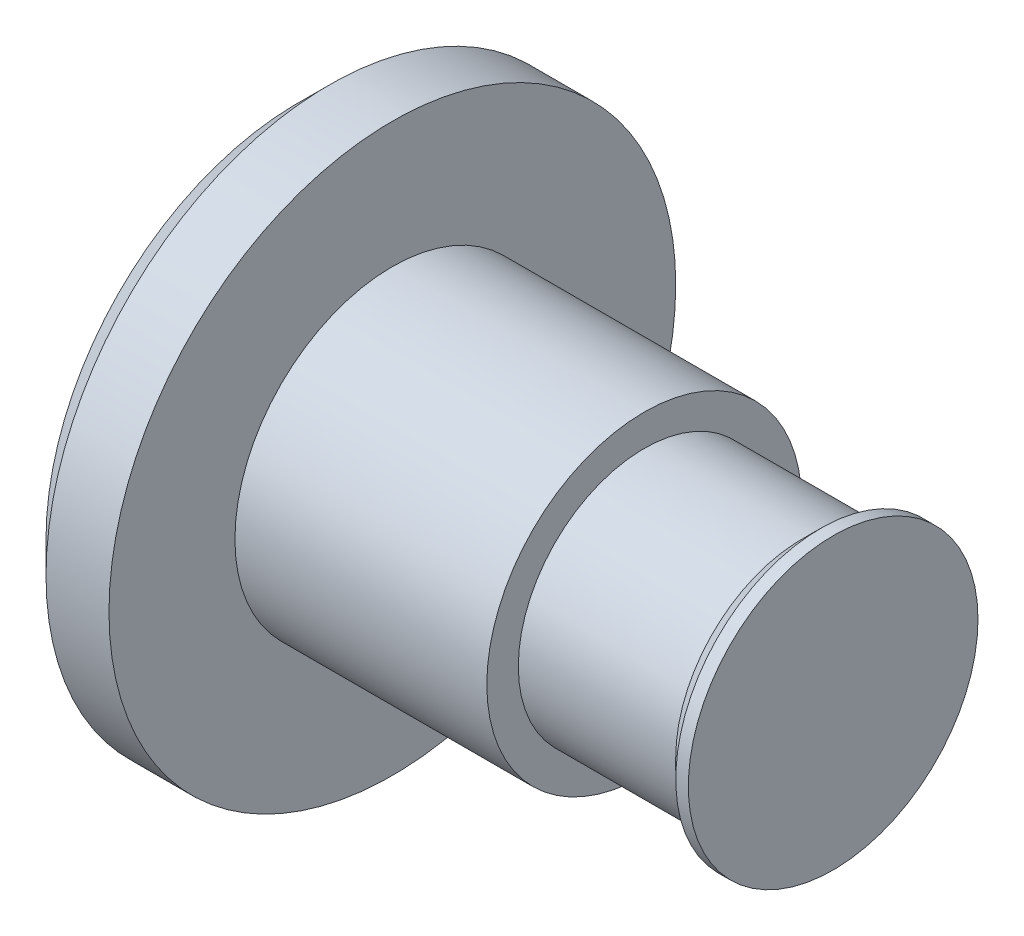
ISO-10303-21;
HEADER;
FILE_DESCRIPTION(('STEP AP214'),'2;1');
FILE_NAME('part.step','',(''),(''),'','','');
FILE_SCHEMA(('AUTOMOTIVE_DESIGN { 1 0 10303 214 1 1 1 1 }'));
ENDSEC;
DATA;
#1=APPLICATION_CONTEXT('core data for automotive mechanical design processes');
#2=APPLICATION_PROTOCOL_DEFINITION('international standard','automotive_design',2000,#1);
#3=PRODUCT_CONTEXT('',#1,'mechanical');
#4=PRODUCT('Part','Part','',(#3));
#5=PRODUCT_RELATED_PRODUCT_CATEGORY('part','',(#4));
#6=PRODUCT_DEFINITION_FORMATION('','',#4);
#7=PRODUCT_DEFINITION_CONTEXT('part definition',#1,'design');
#8=PRODUCT_DEFINITION('design','',#6,#7);
#9=PRODUCT_DEFINITION_SHAPE('','',#8);
#10=(LENGTH_UNIT() NAMED_UNIT(*) SI_UNIT(.MILLI.,.METRE.));
#11=(NAMED_UNIT(*) PLANE_ANGLE_UNIT() SI_UNIT($,.RADIAN.));
#12=(NAMED_UNIT(*) SI_UNIT($,.STERADIAN.) SOLID_ANGLE_UNIT());
#13=UNCERTAINTY_MEASURE_WITH_UNIT(LENGTH_MEASURE(1.E-05),#10,'distance_accuracy_value','');
#14=(GEOMETRIC_REPRESENTATION_CONTEXT(3) GLOBAL_UNCERTAINTY_ASSIGNED_CONTEXT((#13)) GLOBAL_UNIT_ASSIGNED_CONTEXT((#10,
#11,#12)) REPRESENTATION_CONTEXT('',''));
#15=CARTESIAN_POINT('',(0.,0.,0.));
#16=DIRECTION('',(0.,0.,1.));
#17=DIRECTION('',(1.,0.,0.));
#18=AXIS2_PLACEMENT_3D('',#15,#16,#17);
#19=CARTESIAN_POINT('',(8.,0.,0.));
#20=DIRECTION('',(1.,0.,0.));
#21=DIRECTION('',(0.,0.,-1.));
#22=AXIS2_PLACEMENT_3D('',#19,#20,#21);
#23=CONICAL_SURFACE('',#22,2.,0.785398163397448);
#24=CARTESIAN_POINT('',(8.,0.,0.));
#25=DIRECTION('',(-1.,0.,0.));
#26=DIRECTION('',(0.,0.,1.));
#27=AXIS2_PLACEMENT_3D('',#24,#25,#26);
#28=CIRCLE('',#27,2.);
#29=CARTESIAN_POINT('',(8.,0.,2.));
#30=VERTEX_POINT('',#29);
#31=EDGE_CURVE('E60',#30,#30,#28,.T.);
#32=ORIENTED_EDGE('',*,*,#31,.F.);
#33=EDGE_LOOP('',(#32));
#34=FACE_BOUND('',#33,.T.);
#35=CARTESIAN_POINT('',(8.3,0.,0.));
#36=DIRECTION('',(1.,0.,0.));
#37=DIRECTION('',(0.,0.,-1.));
#38=AXIS2_PLACEMENT_3D('',#35,#36,#37);
#39=CIRCLE('',#38,2.3);
#40=CARTESIAN_POINT('',(8.3,0.,-2.3));
#41=VERTEX_POINT('',#40);
#42=EDGE_CURVE('E63',#41,#41,#39,.F.);
#43=ORIENTED_EDGE('',*,*,#42,.T.);
#44=EDGE_LOOP('',(#43));
#45=FACE_BOUND('',#44,.T.);
#46=ADVANCED_FACE('F31',(#34,#45),#23,.T.);
#47=CARTESIAN_POINT('',(0.,0.,0.));
#48=DIRECTION('',(-1.,0.,0.));
#49=DIRECTION('',(0.,0.,1.));
#50=AXIS2_PLACEMENT_3D('',#47,#48,#49);
#51=PLANE('',#50);
#52=CARTESIAN_POINT('',(0.,0.,0.));
#53=DIRECTION('',(-1.,0.,0.));
#54=DIRECTION('',(0.,0.,1.));
#55=AXIS2_PLACEMENT_3D('',#52,#53,#54);
#56=CIRCLE('',#55,4.);
#57=CARTESIAN_POINT('',(0.,0.,4.));
#58=VERTEX_POINT('',#57);
#59=EDGE_CURVE('E10',#58,#58,#56,.T.);
#60=ORIENTED_EDGE('',*,*,#59,.T.);
#61=EDGE_LOOP('',(#60));
#62=FACE_BOUND('',#61,.T.);
#63=ADVANCED_FACE('F33',(#62),#51,.T.);
#64=CARTESIAN_POINT('',(0.,0.,0.));
#65=DIRECTION('',(1.,0.,0.));
#66=DIRECTION('',(0.,0.,-1.));
#67=AXIS2_PLACEMENT_3D('',#64,#65,#66);
#68=CONICAL_SURFACE('',#67,4.,0.785398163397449);
#69=CARTESIAN_POINT('',(0.5,0.,0.));
#70=DIRECTION('',(-1.,0.,0.));
#71=DIRECTION('',(0.,0.,1.));
#72=AXIS2_PLACEMENT_3D('',#69,#70,#71);
#73=CIRCLE('',#72,4.5);
#74=CARTESIAN_POINT('',(0.5,0.,4.5));
#75=VERTEX_POINT('',#74);
#76=EDGE_CURVE('E38',#75,#75,#73,.T.);
#77=ORIENTED_EDGE('',*,*,#76,.T.);
#78=EDGE_LOOP('',(#77));
#79=FACE_BOUND('',#78,.T.);
#80=ORIENTED_EDGE('',*,*,#59,.F.);
#81=EDGE_LOOP('',(#80));
#82=FACE_BOUND('',#81,.T.);
#83=ADVANCED_FACE('F92',(#79,#82),#68,.T.);
#84=CARTESIAN_POINT('',(-1.4,0.,0.));
#85=DIRECTION('',(-1.,0.,0.));
#86=DIRECTION('',(0.,0.,1.));
#87=AXIS2_PLACEMENT_3D('',#84,#85,#86);
#88=CYLINDRICAL_SURFACE('',#87,4.5);
#89=CARTESIAN_POINT('',(1.5,0.,0.));
#90=DIRECTION('',(-1.,0.,0.));
#91=DIRECTION('',(0.,0.,1.));
#92=AXIS2_PLACEMENT_3D('',#89,#90,#91);
#93=CIRCLE('',#92,4.5);
#94=CARTESIAN_POINT('',(1.5,0.,4.5));
#95=VERTEX_POINT('',#94);
#96=EDGE_CURVE('E43',#95,#95,#93,.T.);
#97=ORIENTED_EDGE('',*,*,#96,.T.);
#98=EDGE_LOOP('',(#97));
#99=FACE_BOUND('',#98,.T.);
#100=ORIENTED_EDGE('',*,*,#76,.F.);
#101=EDGE_LOOP('',(#100));
#102=FACE_BOUND('',#101,.T.);
#103=ADVANCED_FACE('F106',(#99,#102),#88,.T.);
#104=CARTESIAN_POINT('',(1.5,4.5,0.));
#105=DIRECTION('',(1.,0.,0.));
#106=DIRECTION('',(0.,0.,-1.));
#107=AXIS2_PLACEMENT_3D('',#104,#105,#106);
#108=PLANE('',#107);
#109=CARTESIAN_POINT('',(1.5,0.,0.));
#110=DIRECTION('',(-1.,0.,0.));
#111=DIRECTION('',(0.,0.,1.));
#112=AXIS2_PLACEMENT_3D('',#109,#110,#111);
#113=CIRCLE('',#112,2.5);
#114=CARTESIAN_POINT('',(1.5,0.,2.5));
#115=VERTEX_POINT('',#114);
#116=EDGE_CURVE('E49',#115,#115,#113,.T.);
#117=ORIENTED_EDGE('',*,*,#116,.T.);
#118=EDGE_LOOP('',(#117));
#119=FACE_BOUND('',#118,.T.);
#120=ORIENTED_EDGE('',*,*,#96,.F.);
#121=EDGE_LOOP('',(#120));
#122=FACE_BOUND('',#121,.T.);
#123=ADVANCED_FACE('F102',(#119,#122),#108,.T.);
#124=CARTESIAN_POINT('',(-1.4,0.,0.));
#125=DIRECTION('',(-1.,0.,0.));
#126=DIRECTION('',(0.,0.,1.));
#127=AXIS2_PLACEMENT_3D('',#124,#125,#126);
#128=CYLINDRICAL_SURFACE('',#127,2.5);
#129=CARTESIAN_POINT('',(5.5,0.,0.));
#130=DIRECTION('',(-1.,0.,0.));
#131=DIRECTION('',(0.,0.,1.));
#132=AXIS2_PLACEMENT_3D('',#129,#130,#131);
#133=CIRCLE('',#132,2.5);
#134=CARTESIAN_POINT('',(5.5,0.,2.5));
#135=VERTEX_POINT('',#134);
#136=EDGE_CURVE('E54',#135,#135,#133,.T.);
#137=ORIENTED_EDGE('',*,*,#136,.T.);
#138=EDGE_LOOP('',(#137));
#139=FACE_BOUND('',#138,.T.);
#140=ORIENTED_EDGE('',*,*,#116,.F.);
#141=EDGE_LOOP('',(#140));
#142=FACE_BOUND('',#141,.T.);
#143=ADVANCED_FACE('F98',(#139,#142),#128,.T.);
#144=CARTESIAN_POINT('',(5.5,2.5,0.));
#145=DIRECTION('',(1.,0.,0.));
#146=DIRECTION('',(0.,0.,-1.));
#147=AXIS2_PLACEMENT_3D('',#144,#145,#146);
#148=PLANE('',#147);
#149=CARTESIAN_POINT('',(5.5,0.,0.));
#150=DIRECTION('',(-1.,0.,0.));
#151=DIRECTION('',(0.,0.,1.));
#152=AXIS2_PLACEMENT_3D('',#149,#150,#151);
#153=CIRCLE('',#152,2.);
#154=CARTESIAN_POINT('',(5.5,0.,2.));
#155=VERTEX_POINT('',#154);
#156=EDGE_CURVE('E57',#155,#155,#153,.T.);
#157=ORIENTED_EDGE('',*,*,#156,.T.);
#158=EDGE_LOOP('',(#157));
#159=FACE_BOUND('',#158,.T.);
#160=ORIENTED_EDGE('',*,*,#136,.F.);
#161=EDGE_LOOP('',(#160));
#162=FACE_BOUND('',#161,.T.);
#163=ADVANCED_FACE('F82',(#159,#162),#148,.T.);
#164=CARTESIAN_POINT('',(-1.4,0.,0.));
#165=DIRECTION('',(-1.,0.,0.));
#166=DIRECTION('',(0.,0.,1.));
#167=AXIS2_PLACEMENT_3D('',#164,#165,#166);
#168=CYLINDRICAL_SURFACE('',#167,2.);
#169=ORIENTED_EDGE('',*,*,#31,.T.);
#170=EDGE_LOOP('',(#169));
#171=FACE_BOUND('',#170,.T.);
#172=ORIENTED_EDGE('',*,*,#156,.F.);
#173=EDGE_LOOP('',(#172));
#174=FACE_BOUND('',#173,.T.);
#175=ADVANCED_FACE('F74',(#171,#174),#168,.T.);
#176=CARTESIAN_POINT('',(6.5,0.,0.));
#177=DIRECTION('',(1.,0.,0.));
#178=DIRECTION('',(0.,0.,-1.));
#179=AXIS2_PLACEMENT_3D('',#176,#177,#178);
#180=CYLINDRICAL_SURFACE('',#179,2.3);
#181=ORIENTED_EDGE('',*,*,#42,.F.);
#182=EDGE_LOOP('',(#181));
#183=FACE_BOUND('',#182,.T.);
#184=CARTESIAN_POINT('',(8.5,0.,0.));
#185=DIRECTION('',(1.,0.,0.));
#186=DIRECTION('',(0.,0.,-1.));
#187=AXIS2_PLACEMENT_3D('',#184,#185,#186);
#188=CIRCLE('',#187,2.3);
#189=CARTESIAN_POINT('',(8.5,0.,-2.3));
#190=VERTEX_POINT('',#189);
#191=EDGE_CURVE('E66',#190,#190,#188,.T.);
#192=ORIENTED_EDGE('',*,*,#191,.F.);
#193=EDGE_LOOP('',(#192));
#194=FACE_BOUND('',#193,.T.);
#195=ADVANCED_FACE('F72',(#183,#194),#180,.T.);
#196=CARTESIAN_POINT('',(8.5,2.5,0.));
#197=DIRECTION('',(1.,0.,0.));
#198=DIRECTION('',(0.,0.,-1.));
#199=AXIS2_PLACEMENT_3D('',#196,#197,#198);
#200=PLANE('',#199);
#201=ORIENTED_EDGE('',*,*,#191,.T.);
#202=EDGE_LOOP('',(#201));
#203=FACE_BOUND('',#202,.T.);
#204=ADVANCED_FACE('F70',(#203),#200,.T.);
#205=CLOSED_SHELL('',(#46,#63,#83,#103,#123,#143,#163,#175,#195,#204));
#206=MANIFOLD_SOLID_BREP('B2',#205);
#207=ADVANCED_BREP_SHAPE_REPRESENTATION('',(#18,#206),#14);
#208=SHAPE_DEFINITION_REPRESENTATION(#9,#207);
ENDSEC;
END-ISO-10303-21;
